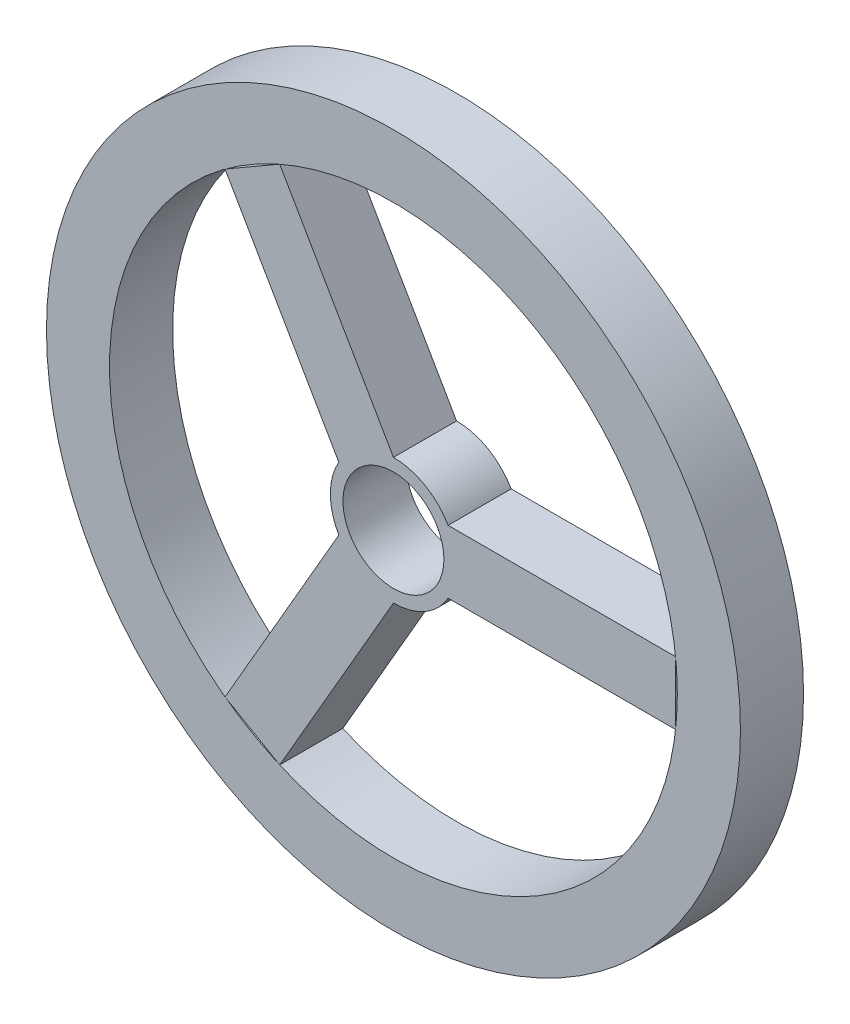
ISO-10303-21;
HEADER;
FILE_DESCRIPTION(('STEP AP214'),'2;1');
FILE_NAME('part.step','',(''),(''),'','','');
FILE_SCHEMA(('AUTOMOTIVE_DESIGN { 1 0 10303 214 1 1 1 1 }'));
ENDSEC;
DATA;
#1=APPLICATION_CONTEXT('core data for automotive mechanical design processes');
#2=APPLICATION_PROTOCOL_DEFINITION('international standard','automotive_design',2000,#1);
#3=PRODUCT_CONTEXT('',#1,'mechanical');
#4=PRODUCT('Part','Part','',(#3));
#5=PRODUCT_RELATED_PRODUCT_CATEGORY('part','',(#4));
#6=PRODUCT_DEFINITION_FORMATION('','',#4);
#7=PRODUCT_DEFINITION_CONTEXT('part definition',#1,'design');
#8=PRODUCT_DEFINITION('design','',#6,#7);
#9=PRODUCT_DEFINITION_SHAPE('','',#8);
#10=(LENGTH_UNIT() NAMED_UNIT(*) SI_UNIT(.MILLI.,.METRE.));
#11=(NAMED_UNIT(*) PLANE_ANGLE_UNIT() SI_UNIT($,.RADIAN.));
#12=(NAMED_UNIT(*) SI_UNIT($,.STERADIAN.) SOLID_ANGLE_UNIT());
#13=UNCERTAINTY_MEASURE_WITH_UNIT(LENGTH_MEASURE(1.E-05),#10,'distance_accuracy_value','');
#14=(GEOMETRIC_REPRESENTATION_CONTEXT(3) GLOBAL_UNCERTAINTY_ASSIGNED_CONTEXT((#13)) GLOBAL_UNIT_ASSIGNED_CONTEXT((#10,
#11,#12)) REPRESENTATION_CONTEXT('',''));
#15=CARTESIAN_POINT('',(0.,0.,0.));
#16=DIRECTION('',(0.,0.,1.));
#17=DIRECTION('',(1.,0.,0.));
#18=AXIS2_PLACEMENT_3D('',#15,#16,#17);
#19=CARTESIAN_POINT('',(0.,0.,10.));
#20=DIRECTION('',(0.,0.,-1.));
#21=DIRECTION('',(-1.,0.,0.));
#22=AXIS2_PLACEMENT_3D('',#19,#20,#21);
#23=CYLINDRICAL_SURFACE('',#22,45.);
#24=CARTESIAN_POINT('',(0.,0.,10.));
#25=DIRECTION('',(0.,0.,1.));
#26=DIRECTION('',(1.,0.,0.));
#27=AXIS2_PLACEMENT_3D('',#24,#25,#26);
#28=CIRCLE('',#27,45.);
#29=CARTESIAN_POINT('',(45.,0.,10.));
#30=VERTEX_POINT('',#29);
#31=EDGE_CURVE('E183',#30,#30,#28,.T.);
#32=ORIENTED_EDGE('',*,*,#31,.T.);
#33=EDGE_LOOP('',(#32));
#34=FACE_BOUND('',#33,.T.);
#35=CARTESIAN_POINT('',(0.,0.,0.));
#36=DIRECTION('',(0.,0.,1.));
#37=DIRECTION('',(1.,0.,0.));
#38=AXIS2_PLACEMENT_3D('',#35,#36,#37);
#39=CIRCLE('',#38,45.);
#40=CARTESIAN_POINT('',(45.,0.,0.));
#41=VERTEX_POINT('',#40);
#42=EDGE_CURVE('E12',#41,#41,#39,.T.);
#43=ORIENTED_EDGE('',*,*,#42,.F.);
#44=EDGE_LOOP('',(#43));
#45=FACE_BOUND('',#44,.T.);
#46=ADVANCED_FACE('F179',(#34,#45),#23,.F.);
#47=CARTESIAN_POINT('',(0.,0.,10.));
#48=DIRECTION('',(0.,0.,-1.));
#49=DIRECTION('',(-1.,0.,0.));
#50=AXIS2_PLACEMENT_3D('',#47,#48,#49);
#51=CYLINDRICAL_SURFACE('',#50,55.);
#52=CARTESIAN_POINT('',(0.,0.,10.));
#53=DIRECTION('',(0.,0.,1.));
#54=DIRECTION('',(1.,0.,0.));
#55=AXIS2_PLACEMENT_3D('',#52,#53,#54);
#56=CIRCLE('',#55,55.);
#57=CARTESIAN_POINT('',(55.,0.,10.));
#58=VERTEX_POINT('',#57);
#59=EDGE_CURVE('E193',#58,#58,#56,.T.);
#60=ORIENTED_EDGE('',*,*,#59,.F.);
#61=EDGE_LOOP('',(#60));
#62=FACE_BOUND('',#61,.T.);
#63=CARTESIAN_POINT('',(0.,0.,0.));
#64=DIRECTION('',(0.,0.,1.));
#65=DIRECTION('',(1.,0.,0.));
#66=AXIS2_PLACEMENT_3D('',#63,#64,#65);
#67=CIRCLE('',#66,55.);
#68=CARTESIAN_POINT('',(55.,0.,0.));
#69=VERTEX_POINT('',#68);
#70=EDGE_CURVE('E187',#69,#69,#67,.T.);
#71=ORIENTED_EDGE('',*,*,#70,.T.);
#72=EDGE_LOOP('',(#71));
#73=FACE_BOUND('',#72,.T.);
#74=ADVANCED_FACE('F204',(#62,#73),#51,.T.);
#75=CARTESIAN_POINT('',(0.,0.,10.));
#76=DIRECTION('',(0.,0.,1.));
#77=DIRECTION('',(1.,0.,0.));
#78=AXIS2_PLACEMENT_3D('',#75,#76,#77);
#79=PLANE('',#78);
#80=ORIENTED_EDGE('',*,*,#31,.F.);
#81=EDGE_LOOP('',(#80));
#82=FACE_BOUND('',#81,.T.);
#83=ORIENTED_EDGE('',*,*,#59,.T.);
#84=EDGE_LOOP('',(#83));
#85=FACE_BOUND('',#84,.T.);
#86=ADVANCED_FACE('F181',(#82,#85),#79,.T.);
#87=CARTESIAN_POINT('',(0.,0.,0.));
#88=DIRECTION('',(0.,0.,1.));
#89=DIRECTION('',(1.,0.,0.));
#90=AXIS2_PLACEMENT_3D('',#87,#88,#89);
#91=PLANE('',#90);
#92=ORIENTED_EDGE('',*,*,#42,.T.);
#93=EDGE_LOOP('',(#92));
#94=FACE_BOUND('',#93,.T.);
#95=ORIENTED_EDGE('',*,*,#70,.F.);
#96=EDGE_LOOP('',(#95));
#97=FACE_BOUND('',#96,.T.);
#98=ADVANCED_FACE('F203',(#94,#97),#91,.F.);
#99=CLOSED_SHELL('',(#46,#74,#86,#98));
#100=MANIFOLD_SOLID_BREP('B2',#99);
#101=CARTESIAN_POINT('',(4.33012701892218,2.50000000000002,10.));
#102=DIRECTION('',(-0.866025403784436,-0.500000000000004,0.));
#103=DIRECTION('',(0.500000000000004,-0.866025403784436,0.));
#104=AXIS2_PLACEMENT_3D('',#101,#102,#103);
#105=PLANE('',#104);
#106=DIRECTION('',(-0.500000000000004,0.866025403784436,0.));
#107=VECTOR('',#106,1.);
#108=CARTESIAN_POINT('',(4.33012701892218,2.50000000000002,0.));
#109=LINE('',#108,#107);
#110=CARTESIAN_POINT('',(0.,10.,0.));
#111=VERTEX_POINT('',#110);
#112=CARTESIAN_POINT('',(-18.0305527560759,41.2298334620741,0.));
#113=VERTEX_POINT('',#112);
#114=EDGE_CURVE('E398',#111,#113,#109,.T.);
#115=ORIENTED_EDGE('',*,*,#114,.T.);
#116=DIRECTION('',(0.,0.,-1.));
#117=VECTOR('',#116,1.);
#118=CARTESIAN_POINT('',(-18.0305527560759,41.2298334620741,10.));
#119=LINE('',#118,#117);
#120=CARTESIAN_POINT('',(-18.0305527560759,41.2298334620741,10.));
#121=VERTEX_POINT('',#120);
#122=EDGE_CURVE('E177',#121,#113,#119,.T.);
#123=ORIENTED_EDGE('',*,*,#122,.F.);
#124=DIRECTION('',(-0.500000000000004,0.866025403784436,0.));
#125=VECTOR('',#124,1.);
#126=CARTESIAN_POINT('',(4.33012701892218,2.50000000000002,10.));
#127=LINE('',#126,#125);
#128=CARTESIAN_POINT('',(0.,10.,10.));
#129=VERTEX_POINT('',#128);
#130=EDGE_CURVE('E390',#129,#121,#127,.T.);
#131=ORIENTED_EDGE('',*,*,#130,.F.);
#132=DIRECTION('',(0.,0.,-1.));
#133=VECTOR('',#132,1.);
#134=CARTESIAN_POINT('',(0.,10.,10.));
#135=LINE('',#134,#133);
#136=EDGE_CURVE('E379',#129,#111,#135,.T.);
#137=ORIENTED_EDGE('',*,*,#136,.T.);
#138=EDGE_LOOP('',(#115,#123,#131,#137));
#139=FACE_BOUND('',#138,.T.);
#140=ADVANCED_FACE('F241',(#139),#105,.F.);
#141=CARTESIAN_POINT('',(-22.3606797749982,38.729833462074,10.));
#142=DIRECTION('',(-0.500000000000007,0.866025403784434,0.));
#143=DIRECTION('',(-0.866025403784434,-0.500000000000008,0.));
#144=AXIS2_PLACEMENT_3D('',#141,#142,#143);
#145=PLANE('',#144);
#146=DIRECTION('',(0.866025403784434,0.500000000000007,0.));
#147=VECTOR('',#146,1.);
#148=CARTESIAN_POINT('',(-22.3606797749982,38.729833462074,0.));
#149=LINE('',#148,#147);
#150=CARTESIAN_POINT('',(-26.6908067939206,36.2298334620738,0.));
#151=VERTEX_POINT('',#150);
#152=EDGE_CURVE('E401',#151,#113,#149,.T.);
#153=ORIENTED_EDGE('',*,*,#152,.F.);
#154=DIRECTION('',(0.,0.,-1.));
#155=VECTOR('',#154,1.);
#156=CARTESIAN_POINT('',(-26.6908067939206,36.2298334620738,10.));
#157=LINE('',#156,#155);
#158=CARTESIAN_POINT('',(-26.6908067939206,36.2298334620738,10.));
#159=VERTEX_POINT('',#158);
#160=EDGE_CURVE('E251',#151,#159,#157,.F.);
#161=ORIENTED_EDGE('',*,*,#160,.T.);
#162=DIRECTION('',(0.866025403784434,0.500000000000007,0.));
#163=VECTOR('',#162,1.);
#164=CARTESIAN_POINT('',(-22.3606797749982,38.729833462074,10.));
#165=LINE('',#164,#163);
#166=EDGE_CURVE('E393',#159,#121,#165,.T.);
#167=ORIENTED_EDGE('',*,*,#166,.T.);
#168=ORIENTED_EDGE('',*,*,#122,.T.);
#169=EDGE_LOOP('',(#153,#161,#167,#168));
#170=FACE_BOUND('',#169,.T.);
#171=ADVANCED_FACE('F444',(#170),#145,.T.);
#172=CARTESIAN_POINT('',(-4.33012701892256,-2.50000000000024,10.));
#173=DIRECTION('',(0.866025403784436,0.500000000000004,0.));
#174=DIRECTION('',(-0.500000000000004,0.866025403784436,0.));
#175=AXIS2_PLACEMENT_3D('',#172,#173,#174);
#176=PLANE('',#175);
#177=DIRECTION('',(0.500000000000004,-0.866025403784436,0.));
#178=VECTOR('',#177,1.);
#179=CARTESIAN_POINT('',(-4.33012701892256,-2.50000000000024,0.));
#180=LINE('',#179,#178);
#181=CARTESIAN_POINT('',(-8.66025403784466,4.99999999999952,0.));
#182=VERTEX_POINT('',#181);
#183=EDGE_CURVE('E394',#151,#182,#180,.T.);
#184=ORIENTED_EDGE('',*,*,#183,.T.);
#185=DIRECTION('',(0.,0.,-1.));
#186=VECTOR('',#185,1.);
#187=CARTESIAN_POINT('',(-8.66025403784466,4.99999999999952,10.));
#188=LINE('',#187,#186);
#189=CARTESIAN_POINT('',(-8.66025403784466,4.99999999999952,10.));
#190=VERTEX_POINT('',#189);
#191=EDGE_CURVE('E383',#190,#182,#188,.T.);
#192=ORIENTED_EDGE('',*,*,#191,.F.);
#193=DIRECTION('',(0.500000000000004,-0.866025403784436,0.));
#194=VECTOR('',#193,1.);
#195=CARTESIAN_POINT('',(-4.33012701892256,-2.50000000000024,10.));
#196=LINE('',#195,#194);
#197=EDGE_CURVE('E367',#159,#190,#196,.T.);
#198=ORIENTED_EDGE('',*,*,#197,.F.);
#199=ORIENTED_EDGE('',*,*,#160,.F.);
#200=EDGE_LOOP('',(#184,#192,#198,#199));
#201=FACE_BOUND('',#200,.T.);
#202=ADVANCED_FACE('F448',(#201),#176,.F.);
#203=CARTESIAN_POINT('',(0.,0.,0.));
#204=DIRECTION('',(0.,0.,1.));
#205=DIRECTION('',(1.,0.,0.));
#206=AXIS2_PLACEMENT_3D('',#203,#204,#205);
#207=PLANE('',#206);
#208=ORIENTED_EDGE('',*,*,#114,.F.);
#209=CARTESIAN_POINT('',(0.,0.,0.));
#210=DIRECTION('',(0.,0.,1.));
#211=DIRECTION('',(1.,0.,0.));
#212=AXIS2_PLACEMENT_3D('',#209,#210,#211);
#213=CIRCLE('',#212,10.);
#214=CARTESIAN_POINT('',(8.66025403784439,5.,0.));
#215=VERTEX_POINT('',#214);
#216=EDGE_CURVE('E333',#215,#111,#213,.T.);
#217=ORIENTED_EDGE('',*,*,#216,.F.);
#218=DIRECTION('',(1.,0.,0.));
#219=VECTOR('',#218,1.);
#220=CARTESIAN_POINT('',(0.,5.,0.));
#221=LINE('',#220,#219);
#222=CARTESIAN_POINT('',(44.7213595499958,5.00000000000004,0.));
#223=VERTEX_POINT('',#222);
#224=EDGE_CURVE('E411',#215,#223,#221,.T.);
#225=ORIENTED_EDGE('',*,*,#224,.T.);
#226=DIRECTION('',(0.,-1.,0.));
#227=VECTOR('',#226,1.);
#228=CARTESIAN_POINT('',(44.7213595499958,0.,0.));
#229=LINE('',#228,#227);
#230=CARTESIAN_POINT('',(44.7213595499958,-4.99999999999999,0.));
#231=VERTEX_POINT('',#230);
#232=EDGE_CURVE('E418',#223,#231,#229,.T.);
#233=ORIENTED_EDGE('',*,*,#232,.T.);
#234=DIRECTION('',(1.,0.,0.));
#235=VECTOR('',#234,1.);
#236=CARTESIAN_POINT('',(0.,-5.,0.));
#237=LINE('',#236,#235);
#238=CARTESIAN_POINT('',(8.66025403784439,-5.,0.));
#239=VERTEX_POINT('',#238);
#240=EDGE_CURVE('E331',#239,#231,#237,.T.);
#241=ORIENTED_EDGE('',*,*,#240,.F.);
#242=CARTESIAN_POINT('',(1.11109038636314E-12,-10.,0.));
#243=VERTEX_POINT('',#242);
#244=EDGE_CURVE('E245',#243,#239,#213,.T.);
#245=ORIENTED_EDGE('',*,*,#244,.F.);
#246=DIRECTION('',(0.499999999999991,0.866025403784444,0.));
#247=VECTOR('',#246,1.);
#248=CARTESIAN_POINT('',(4.33012701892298,-2.5000000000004,0.));
#249=LINE('',#248,#247);
#250=CARTESIAN_POINT('',(-18.0305527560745,-41.2298334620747,0.));
#251=VERTEX_POINT('',#250);
#252=EDGE_CURVE('E328',#251,#243,#249,.T.);
#253=ORIENTED_EDGE('',*,*,#252,.F.);
#254=DIRECTION('',(0.866025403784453,-0.499999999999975,0.));
#255=VECTOR('',#254,1.);
#256=CARTESIAN_POINT('',(-22.3606797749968,-38.7298334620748,0.));
#257=LINE('',#256,#255);
#258=CARTESIAN_POINT('',(-26.6908067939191,-36.2298334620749,0.));
#259=VERTEX_POINT('',#258);
#260=EDGE_CURVE('E338',#259,#251,#257,.T.);
#261=ORIENTED_EDGE('',*,*,#260,.F.);
#262=DIRECTION('',(0.499999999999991,0.866025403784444,0.));
#263=VECTOR('',#262,1.);
#264=CARTESIAN_POINT('',(-4.33012701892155,2.49999999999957,0.));
#265=LINE('',#264,#263);
#266=CARTESIAN_POINT('',(-8.66025403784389,-5.00000000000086,0.));
#267=VERTEX_POINT('',#266);
#268=EDGE_CURVE('E343',#259,#267,#265,.T.);
#269=ORIENTED_EDGE('',*,*,#268,.T.);
#270=EDGE_CURVE('E302',#182,#267,#213,.T.);
#271=ORIENTED_EDGE('',*,*,#270,.F.);
#272=ORIENTED_EDGE('',*,*,#183,.F.);
#273=ORIENTED_EDGE('',*,*,#152,.T.);
#274=EDGE_LOOP('',(#208,#217,#225,#233,#241,#245,#253,#261,#269,#271,#272,#273));
#275=FACE_BOUND('',#274,.T.);
#276=CARTESIAN_POINT('',(0.,0.,0.));
#277=DIRECTION('',(0.,0.,1.));
#278=DIRECTION('',(1.,0.,0.));
#279=AXIS2_PLACEMENT_3D('',#276,#277,#278);
#280=CIRCLE('',#279,8.);
#281=CARTESIAN_POINT('',(8.,0.,0.));
#282=VERTEX_POINT('',#281);
#283=EDGE_CURVE('E351',#282,#282,#280,.T.);
#284=ORIENTED_EDGE('',*,*,#283,.T.);
#285=EDGE_LOOP('',(#284));
#286=FACE_BOUND('',#285,.T.);
#287=ADVANCED_FACE('F324',(#275,#286),#207,.F.);
#288=CARTESIAN_POINT('',(0.,0.,10.));
#289=DIRECTION('',(0.,0.,1.));
#290=DIRECTION('',(1.,0.,0.));
#291=AXIS2_PLACEMENT_3D('',#288,#289,#290);
#292=PLANE('',#291);
#293=ORIENTED_EDGE('',*,*,#197,.T.);
#294=CARTESIAN_POINT('',(0.,0.,10.));
#295=DIRECTION('',(0.,0.,1.));
#296=DIRECTION('',(1.,0.,0.));
#297=AXIS2_PLACEMENT_3D('',#294,#295,#296);
#298=CIRCLE('',#297,10.);
#299=CARTESIAN_POINT('',(-8.66025403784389,-5.00000000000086,10.));
#300=VERTEX_POINT('',#299);
#301=EDGE_CURVE('E332',#190,#300,#298,.T.);
#302=ORIENTED_EDGE('',*,*,#301,.T.);
#303=DIRECTION('',(0.499999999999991,0.866025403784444,0.));
#304=VECTOR('',#303,1.);
#305=CARTESIAN_POINT('',(-4.33012701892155,2.49999999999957,10.));
#306=LINE('',#305,#304);
#307=CARTESIAN_POINT('',(-26.6908067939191,-36.2298334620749,10.));
#308=VERTEX_POINT('',#307);
#309=EDGE_CURVE('E337',#308,#300,#306,.T.);
#310=ORIENTED_EDGE('',*,*,#309,.F.);
#311=DIRECTION('',(0.866025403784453,-0.499999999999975,0.));
#312=VECTOR('',#311,1.);
#313=CARTESIAN_POINT('',(-22.3606797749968,-38.7298334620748,10.));
#314=LINE('',#313,#312);
#315=CARTESIAN_POINT('',(-18.0305527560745,-41.2298334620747,10.));
#316=VERTEX_POINT('',#315);
#317=EDGE_CURVE('E341',#308,#316,#314,.T.);
#318=ORIENTED_EDGE('',*,*,#317,.T.);
#319=DIRECTION('',(0.499999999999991,0.866025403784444,0.));
#320=VECTOR('',#319,1.);
#321=CARTESIAN_POINT('',(4.33012701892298,-2.5000000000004,10.));
#322=LINE('',#321,#320);
#323=CARTESIAN_POINT('',(1.11109038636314E-12,-10.,10.));
#324=VERTEX_POINT('',#323);
#325=EDGE_CURVE('E319',#316,#324,#322,.T.);
#326=ORIENTED_EDGE('',*,*,#325,.T.);
#327=CARTESIAN_POINT('',(8.66025403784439,-5.,10.));
#328=VERTEX_POINT('',#327);
#329=EDGE_CURVE('E313',#324,#328,#298,.T.);
#330=ORIENTED_EDGE('',*,*,#329,.T.);
#331=DIRECTION('',(1.,0.,0.));
#332=VECTOR('',#331,1.);
#333=CARTESIAN_POINT('',(0.,-5.,10.));
#334=LINE('',#333,#332);
#335=CARTESIAN_POINT('',(44.7213595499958,-5.0000000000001,10.));
#336=VERTEX_POINT('',#335);
#337=EDGE_CURVE('E408',#328,#336,#334,.T.);
#338=ORIENTED_EDGE('',*,*,#337,.T.);
#339=DIRECTION('',(0.,-1.,0.));
#340=VECTOR('',#339,1.);
#341=CARTESIAN_POINT('',(44.7213595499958,0.,10.));
#342=LINE('',#341,#340);
#343=CARTESIAN_POINT('',(44.7213595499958,5.,10.));
#344=VERTEX_POINT('',#343);
#345=EDGE_CURVE('E410',#344,#336,#342,.T.);
#346=ORIENTED_EDGE('',*,*,#345,.F.);
#347=DIRECTION('',(1.,0.,0.));
#348=VECTOR('',#347,1.);
#349=CARTESIAN_POINT('',(0.,5.,10.));
#350=LINE('',#349,#348);
#351=CARTESIAN_POINT('',(8.66025403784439,5.,10.));
#352=VERTEX_POINT('',#351);
#353=EDGE_CURVE('E413',#352,#344,#350,.T.);
#354=ORIENTED_EDGE('',*,*,#353,.F.);
#355=EDGE_CURVE('E353',#352,#129,#298,.T.);
#356=ORIENTED_EDGE('',*,*,#355,.T.);
#357=ORIENTED_EDGE('',*,*,#130,.T.);
#358=ORIENTED_EDGE('',*,*,#166,.F.);
#359=EDGE_LOOP('',(#293,#302,#310,#318,#326,#330,#338,#346,#354,#356,#357,#358));
#360=FACE_BOUND('',#359,.T.);
#361=CARTESIAN_POINT('',(0.,0.,10.));
#362=DIRECTION('',(0.,0.,1.));
#363=DIRECTION('',(1.,0.,0.));
#364=AXIS2_PLACEMENT_3D('',#361,#362,#363);
#365=CIRCLE('',#364,8.);
#366=CARTESIAN_POINT('',(8.,0.,10.));
#367=VERTEX_POINT('',#366);
#368=EDGE_CURVE('E348',#367,#367,#365,.T.);
#369=ORIENTED_EDGE('',*,*,#368,.F.);
#370=EDGE_LOOP('',(#369));
#371=FACE_BOUND('',#370,.T.);
#372=ADVANCED_FACE('F361',(#360,#371),#292,.T.);
#373=CARTESIAN_POINT('',(0.,-5.,10.));
#374=DIRECTION('',(0.,1.,0.));
#375=DIRECTION('',(-1.,0.,0.));
#376=AXIS2_PLACEMENT_3D('',#373,#374,#375);
#377=PLANE('',#376);
#378=ORIENTED_EDGE('',*,*,#240,.T.);
#379=DIRECTION('',(0.,0.,-1.));
#380=VECTOR('',#379,1.);
#381=CARTESIAN_POINT('',(44.7213595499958,-5.0000000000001,10.));
#382=LINE('',#381,#380);
#383=EDGE_CURVE('E260',#336,#231,#382,.T.);
#384=ORIENTED_EDGE('',*,*,#383,.F.);
#385=ORIENTED_EDGE('',*,*,#337,.F.);
#386=DIRECTION('',(0.,0.,-1.));
#387=VECTOR('',#386,1.);
#388=CARTESIAN_POINT('',(8.66025403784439,-5.,10.));
#389=LINE('',#388,#387);
#390=EDGE_CURVE('E402',#328,#239,#389,.T.);
#391=ORIENTED_EDGE('',*,*,#390,.T.);
#392=EDGE_LOOP('',(#378,#384,#385,#391));
#393=FACE_BOUND('',#392,.T.);
#394=ADVANCED_FACE('F463',(#393),#377,.F.);
#395=CARTESIAN_POINT('',(44.7213595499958,0.,10.));
#396=DIRECTION('',(1.,0.,0.));
#397=DIRECTION('',(0.,1.,0.));
#398=AXIS2_PLACEMENT_3D('',#395,#396,#397);
#399=PLANE('',#398);
#400=ORIENTED_EDGE('',*,*,#232,.F.);
#401=DIRECTION('',(0.,0.,-1.));
#402=VECTOR('',#401,1.);
#403=CARTESIAN_POINT('',(44.7213595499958,5.,10.));
#404=LINE('',#403,#402);
#405=EDGE_CURVE('E378',#344,#223,#404,.T.);
#406=ORIENTED_EDGE('',*,*,#405,.F.);
#407=ORIENTED_EDGE('',*,*,#345,.T.);
#408=ORIENTED_EDGE('',*,*,#383,.T.);
#409=EDGE_LOOP('',(#400,#406,#407,#408));
#410=FACE_BOUND('',#409,.T.);
#411=ADVANCED_FACE('F462',(#410),#399,.T.);
#412=CARTESIAN_POINT('',(-22.3606797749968,-38.7298334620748,10.));
#413=DIRECTION('',(0.499999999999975,0.866025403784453,0.));
#414=DIRECTION('',(-0.866025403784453,0.499999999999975,0.));
#415=AXIS2_PLACEMENT_3D('',#412,#413,#414);
#416=PLANE('',#415);
#417=ORIENTED_EDGE('',*,*,#260,.T.);
#418=DIRECTION('',(0.,0.,-1.));
#419=VECTOR('',#418,1.);
#420=CARTESIAN_POINT('',(-18.0305527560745,-41.2298334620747,10.));
#421=LINE('',#420,#419);
#422=EDGE_CURVE('E336',#251,#316,#421,.F.);
#423=ORIENTED_EDGE('',*,*,#422,.T.);
#424=ORIENTED_EDGE('',*,*,#317,.F.);
#425=DIRECTION('',(0.,0.,-1.));
#426=VECTOR('',#425,1.);
#427=CARTESIAN_POINT('',(-26.6908067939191,-36.2298334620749,10.));
#428=LINE('',#427,#426);
#429=EDGE_CURVE('E374',#259,#308,#428,.F.);
#430=ORIENTED_EDGE('',*,*,#429,.F.);
#431=EDGE_LOOP('',(#417,#423,#424,#430));
#432=FACE_BOUND('',#431,.T.);
#433=ADVANCED_FACE('F425',(#432),#416,.F.);
#434=CARTESIAN_POINT('',(4.33012701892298,-2.5000000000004,10.));
#435=DIRECTION('',(-0.866025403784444,0.499999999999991,0.));
#436=DIRECTION('',(-0.499999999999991,-0.866025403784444,0.));
#437=AXIS2_PLACEMENT_3D('',#434,#435,#436);
#438=PLANE('',#437);
#439=ORIENTED_EDGE('',*,*,#252,.T.);
#440=DIRECTION('',(0.,0.,-1.));
#441=VECTOR('',#440,1.);
#442=CARTESIAN_POINT('',(1.11109038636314E-12,-10.,10.));
#443=LINE('',#442,#441);
#444=EDGE_CURVE('E308',#324,#243,#443,.T.);
#445=ORIENTED_EDGE('',*,*,#444,.F.);
#446=ORIENTED_EDGE('',*,*,#325,.F.);
#447=ORIENTED_EDGE('',*,*,#422,.F.);
#448=EDGE_LOOP('',(#439,#445,#446,#447));
#449=FACE_BOUND('',#448,.T.);
#450=ADVANCED_FACE('F335',(#449),#438,.F.);
#451=CARTESIAN_POINT('',(0.,5.,10.));
#452=DIRECTION('',(0.,1.,0.));
#453=DIRECTION('',(0.,0.,1.));
#454=AXIS2_PLACEMENT_3D('',#451,#452,#453);
#455=PLANE('',#454);
#456=ORIENTED_EDGE('',*,*,#224,.F.);
#457=DIRECTION('',(0.,0.,-1.));
#458=VECTOR('',#457,1.);
#459=CARTESIAN_POINT('',(8.66025403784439,5.,10.));
#460=LINE('',#459,#458);
#461=EDGE_CURVE('E416',#352,#215,#460,.T.);
#462=ORIENTED_EDGE('',*,*,#461,.F.);
#463=ORIENTED_EDGE('',*,*,#353,.T.);
#464=ORIENTED_EDGE('',*,*,#405,.T.);
#465=EDGE_LOOP('',(#456,#462,#463,#464));
#466=FACE_BOUND('',#465,.T.);
#467=ADVANCED_FACE('F457',(#466),#455,.T.);
#468=CARTESIAN_POINT('',(-4.33012701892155,2.49999999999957,10.));
#469=DIRECTION('',(-0.866025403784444,0.499999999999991,0.));
#470=DIRECTION('',(-0.499999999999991,-0.866025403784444,0.));
#471=AXIS2_PLACEMENT_3D('',#468,#469,#470);
#472=PLANE('',#471);
#473=ORIENTED_EDGE('',*,*,#268,.F.);
#474=ORIENTED_EDGE('',*,*,#429,.T.);
#475=ORIENTED_EDGE('',*,*,#309,.T.);
#476=DIRECTION('',(0.,0.,-1.));
#477=VECTOR('',#476,1.);
#478=CARTESIAN_POINT('',(-8.66025403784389,-5.00000000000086,10.));
#479=LINE('',#478,#477);
#480=EDGE_CURVE('E318',#300,#267,#479,.T.);
#481=ORIENTED_EDGE('',*,*,#480,.T.);
#482=EDGE_LOOP('',(#473,#474,#475,#481));
#483=FACE_BOUND('',#482,.T.);
#484=ADVANCED_FACE('F372',(#483),#472,.T.);
#485=CARTESIAN_POINT('',(0.,0.,10.));
#486=DIRECTION('',(0.,0.,-1.));
#487=DIRECTION('',(-1.,0.,0.));
#488=AXIS2_PLACEMENT_3D('',#485,#486,#487);
#489=CYLINDRICAL_SURFACE('',#488,8.);
#490=ORIENTED_EDGE('',*,*,#368,.T.);
#491=EDGE_LOOP('',(#490));
#492=FACE_BOUND('',#491,.T.);
#493=ORIENTED_EDGE('',*,*,#283,.F.);
#494=EDGE_LOOP('',(#493));
#495=FACE_BOUND('',#494,.T.);
#496=ADVANCED_FACE('F474',(#492,#495),#489,.F.);
#497=CARTESIAN_POINT('',(0.,0.,10.));
#498=DIRECTION('',(0.,0.,-1.));
#499=DIRECTION('',(-1.,0.,0.));
#500=AXIS2_PLACEMENT_3D('',#497,#498,#499);
#501=CYLINDRICAL_SURFACE('',#500,10.);
#502=ORIENTED_EDGE('',*,*,#244,.T.);
#503=ORIENTED_EDGE('',*,*,#390,.F.);
#504=ORIENTED_EDGE('',*,*,#329,.F.);
#505=ORIENTED_EDGE('',*,*,#444,.T.);
#506=EDGE_LOOP('',(#502,#503,#504,#505));
#507=FACE_BOUND('',#506,.T.);
#508=ADVANCED_FACE('F310',(#507),#501,.T.);
#509=ORIENTED_EDGE('',*,*,#216,.T.);
#510=ORIENTED_EDGE('',*,*,#136,.F.);
#511=ORIENTED_EDGE('',*,*,#355,.F.);
#512=ORIENTED_EDGE('',*,*,#461,.T.);
#513=EDGE_LOOP('',(#509,#510,#511,#512));
#514=FACE_BOUND('',#513,.T.);
#515=ADVANCED_FACE('F243',(#514),#501,.T.);
#516=ORIENTED_EDGE('',*,*,#301,.F.);
#517=ORIENTED_EDGE('',*,*,#191,.T.);
#518=ORIENTED_EDGE('',*,*,#270,.T.);
#519=ORIENTED_EDGE('',*,*,#480,.F.);
#520=EDGE_LOOP('',(#516,#517,#518,#519));
#521=FACE_BOUND('',#520,.T.);
#522=ADVANCED_FACE('F368',(#521),#501,.T.);
#523=CLOSED_SHELL('',(#140,#171,#202,#287,#372,#394,#411,#433,#450,#467,#484,#496,#508,#515,#522));
#524=MANIFOLD_SOLID_BREP('B7',#523);
#525=ADVANCED_BREP_SHAPE_REPRESENTATION('',(#18,#100,#524),#14);
#526=SHAPE_DEFINITION_REPRESENTATION(#9,#525);
ENDSEC;
END-ISO-10303-21;
